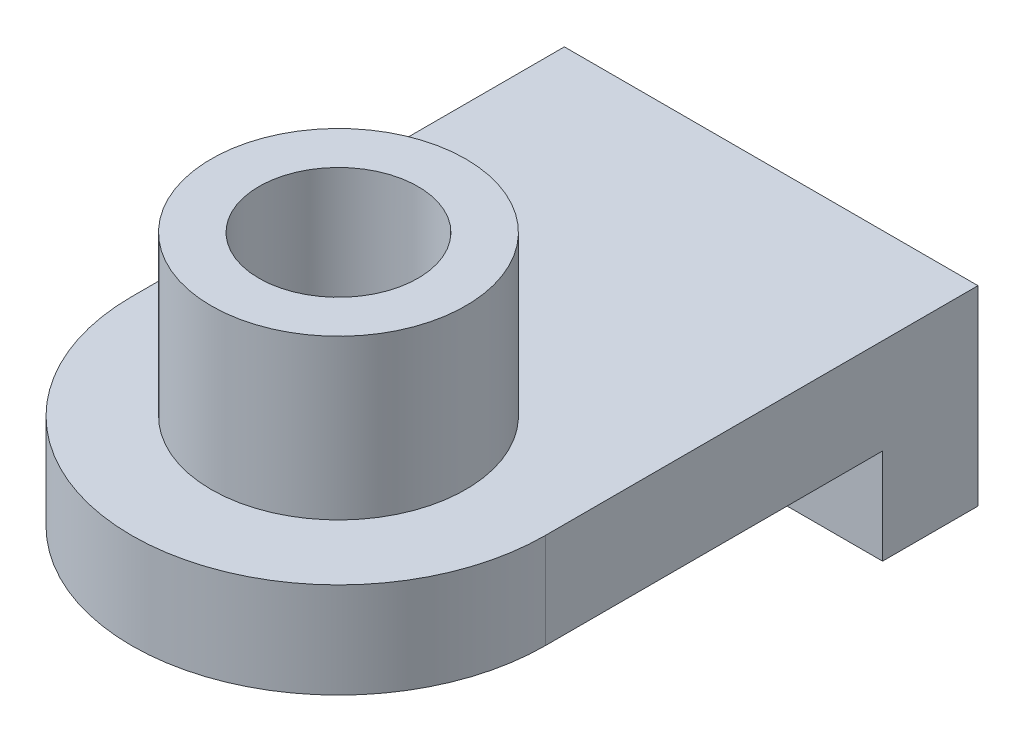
ISO-10303-21;
HEADER;
FILE_DESCRIPTION(('STEP AP214'),'2;1');
FILE_NAME('part.step','',(''),(''),'','','');
FILE_SCHEMA(('AUTOMOTIVE_DESIGN { 1 0 10303 214 1 1 1 1 }'));
ENDSEC;
DATA;
#1=APPLICATION_CONTEXT('core data for automotive mechanical design processes');
#2=APPLICATION_PROTOCOL_DEFINITION('international standard','automotive_design',2000,#1);
#3=PRODUCT_CONTEXT('',#1,'mechanical');
#4=PRODUCT('Part','Part','',(#3));
#5=PRODUCT_RELATED_PRODUCT_CATEGORY('part','',(#4));
#6=PRODUCT_DEFINITION_FORMATION('','',#4);
#7=PRODUCT_DEFINITION_CONTEXT('part definition',#1,'design');
#8=PRODUCT_DEFINITION('design','',#6,#7);
#9=PRODUCT_DEFINITION_SHAPE('','',#8);
#10=(LENGTH_UNIT() NAMED_UNIT(*) SI_UNIT(.MILLI.,.METRE.));
#11=(NAMED_UNIT(*) PLANE_ANGLE_UNIT() SI_UNIT($,.RADIAN.));
#12=(NAMED_UNIT(*) SI_UNIT($,.STERADIAN.) SOLID_ANGLE_UNIT());
#13=UNCERTAINTY_MEASURE_WITH_UNIT(LENGTH_MEASURE(1.E-05),#10,'distance_accuracy_value','');
#14=(GEOMETRIC_REPRESENTATION_CONTEXT(3) GLOBAL_UNCERTAINTY_ASSIGNED_CONTEXT((#13)) GLOBAL_UNIT_ASSIGNED_CONTEXT((#10,
#11,#12)) REPRESENTATION_CONTEXT('',''));
#15=CARTESIAN_POINT('',(0.,0.,0.));
#16=DIRECTION('',(0.,0.,1.));
#17=DIRECTION('',(1.,0.,0.));
#18=AXIS2_PLACEMENT_3D('',#15,#16,#17);
#19=CARTESIAN_POINT('',(0.,15.,0.));
#20=DIRECTION('',(0.,-1.,0.));
#21=DIRECTION('',(0.,0.,-1.));
#22=AXIS2_PLACEMENT_3D('',#19,#20,#21);
#23=PLANE('',#22);
#24=CARTESIAN_POINT('',(0.,15.,0.));
#25=DIRECTION('',(0.,1.,0.));
#26=DIRECTION('',(0.,0.,-1.));
#27=AXIS2_PLACEMENT_3D('',#24,#25,#26);
#28=CIRCLE('',#27,32.5);
#29=CARTESIAN_POINT('',(-32.5,15.,0.));
#30=VERTEX_POINT('',#29);
#31=CARTESIAN_POINT('',(32.5,15.,0.));
#32=VERTEX_POINT('',#31);
#33=EDGE_CURVE('E125',#30,#32,#28,.T.);
#34=ORIENTED_EDGE('',*,*,#33,.T.);
#35=DIRECTION('',(0.,0.,-1.));
#36=VECTOR('',#35,1.);
#37=CARTESIAN_POINT('',(32.5,15.,-68.));
#38=LINE('',#37,#36);
#39=CARTESIAN_POINT('',(32.5,15.,-68.));
#40=VERTEX_POINT('',#39);
#41=EDGE_CURVE('E77',#32,#40,#38,.T.);
#42=ORIENTED_EDGE('',*,*,#41,.T.);
#43=DIRECTION('',(-1.,0.,0.));
#44=VECTOR('',#43,1.);
#45=CARTESIAN_POINT('',(-32.5,15.,-68.));
#46=LINE('',#45,#44);
#47=CARTESIAN_POINT('',(-32.5,15.,-68.));
#48=VERTEX_POINT('',#47);
#49=EDGE_CURVE('E156',#40,#48,#46,.T.);
#50=ORIENTED_EDGE('',*,*,#49,.T.);
#51=DIRECTION('',(0.,0.,1.));
#52=VECTOR('',#51,1.);
#53=CARTESIAN_POINT('',(-32.5,15.,0.));
#54=LINE('',#53,#52);
#55=EDGE_CURVE('E56',#48,#30,#54,.T.);
#56=ORIENTED_EDGE('',*,*,#55,.T.);
#57=EDGE_LOOP('',(#34,#42,#50,#56));
#58=FACE_BOUND('',#57,.T.);
#59=CARTESIAN_POINT('',(0.,15.,0.));
#60=DIRECTION('',(0.,-1.,0.));
#61=DIRECTION('',(0.,0.,-1.));
#62=AXIS2_PLACEMENT_3D('',#59,#60,#61);
#63=CIRCLE('',#62,20.);
#64=CARTESIAN_POINT('',(0.,15.,-20.));
#65=VERTEX_POINT('',#64);
#66=EDGE_CURVE('E11',#65,#65,#63,.F.);
#67=ORIENTED_EDGE('',*,*,#66,.F.);
#68=EDGE_LOOP('',(#67));
#69=FACE_BOUND('',#68,.T.);
#70=ADVANCED_FACE('F32',(#58,#69),#23,.F.);
#71=CARTESIAN_POINT('',(0.,15.,0.));
#72=DIRECTION('',(0.,-1.,0.));
#73=DIRECTION('',(0.,0.,-1.));
#74=AXIS2_PLACEMENT_3D('',#71,#72,#73);
#75=CYLINDRICAL_SURFACE('',#74,32.5);
#76=CARTESIAN_POINT('',(0.,0.,0.));
#77=DIRECTION('',(0.,1.,0.));
#78=DIRECTION('',(0.,0.,-1.));
#79=AXIS2_PLACEMENT_3D('',#76,#77,#78);
#80=CIRCLE('',#79,32.5);
#81=CARTESIAN_POINT('',(-32.5,0.,0.));
#82=VERTEX_POINT('',#81);
#83=CARTESIAN_POINT('',(32.5,0.,0.));
#84=VERTEX_POINT('',#83);
#85=EDGE_CURVE('E137',#82,#84,#80,.T.);
#86=ORIENTED_EDGE('',*,*,#85,.T.);
#87=DIRECTION('',(0.,-1.,0.));
#88=VECTOR('',#87,1.);
#89=CARTESIAN_POINT('',(32.5,15.,0.));
#90=LINE('',#89,#88);
#91=EDGE_CURVE('E40',#32,#84,#90,.T.);
#92=ORIENTED_EDGE('',*,*,#91,.F.);
#93=ORIENTED_EDGE('',*,*,#33,.F.);
#94=DIRECTION('',(0.,-1.,0.));
#95=VECTOR('',#94,1.);
#96=CARTESIAN_POINT('',(-32.5,15.,0.));
#97=LINE('',#96,#95);
#98=EDGE_CURVE('E101',#30,#82,#97,.T.);
#99=ORIENTED_EDGE('',*,*,#98,.T.);
#100=EDGE_LOOP('',(#86,#92,#93,#99));
#101=FACE_BOUND('',#100,.T.);
#102=ADVANCED_FACE('F34',(#101),#75,.T.);
#103=CARTESIAN_POINT('',(32.5,15.,-68.));
#104=DIRECTION('',(-1.,0.,0.));
#105=DIRECTION('',(0.,0.,1.));
#106=AXIS2_PLACEMENT_3D('',#103,#104,#105);
#107=PLANE('',#106);
#108=DIRECTION('',(0.,0.,-1.));
#109=VECTOR('',#108,1.);
#110=CARTESIAN_POINT('',(32.5,0.,-68.));
#111=LINE('',#110,#109);
#112=CARTESIAN_POINT('',(32.5,0.,-53.));
#113=VERTEX_POINT('',#112);
#114=EDGE_CURVE('E129',#84,#113,#111,.T.);
#115=ORIENTED_EDGE('',*,*,#114,.T.);
#116=DIRECTION('',(0.,1.,0.));
#117=VECTOR('',#116,1.);
#118=CARTESIAN_POINT('',(32.5,-15.,-53.));
#119=LINE('',#118,#117);
#120=CARTESIAN_POINT('',(32.5,-15.,-53.));
#121=VERTEX_POINT('',#120);
#122=EDGE_CURVE('E133',#121,#113,#119,.T.);
#123=ORIENTED_EDGE('',*,*,#122,.F.);
#124=DIRECTION('',(0.,0.,1.));
#125=VECTOR('',#124,1.);
#126=CARTESIAN_POINT('',(32.5,-15.,-68.));
#127=LINE('',#126,#125);
#128=CARTESIAN_POINT('',(32.5,-15.,-68.));
#129=VERTEX_POINT('',#128);
#130=EDGE_CURVE('E108',#129,#121,#127,.T.);
#131=ORIENTED_EDGE('',*,*,#130,.F.);
#132=DIRECTION('',(0.,-1.,0.));
#133=VECTOR('',#132,1.);
#134=CARTESIAN_POINT('',(32.5,15.,-68.));
#135=LINE('',#134,#133);
#136=EDGE_CURVE('E100',#40,#129,#135,.T.);
#137=ORIENTED_EDGE('',*,*,#136,.F.);
#138=ORIENTED_EDGE('',*,*,#41,.F.);
#139=ORIENTED_EDGE('',*,*,#91,.T.);
#140=EDGE_LOOP('',(#115,#123,#131,#137,#138,#139));
#141=FACE_BOUND('',#140,.T.);
#142=ADVANCED_FACE('F154',(#141),#107,.F.);
#143=CARTESIAN_POINT('',(-32.5,15.,-68.));
#144=DIRECTION('',(0.,0.,1.));
#145=DIRECTION('',(1.,0.,0.));
#146=AXIS2_PLACEMENT_3D('',#143,#144,#145);
#147=PLANE('',#146);
#148=ORIENTED_EDGE('',*,*,#136,.T.);
#149=DIRECTION('',(1.,0.,0.));
#150=VECTOR('',#149,1.);
#151=CARTESIAN_POINT('',(-32.5,-15.,-68.));
#152=LINE('',#151,#150);
#153=CARTESIAN_POINT('',(-32.5,-15.,-68.));
#154=VERTEX_POINT('',#153);
#155=EDGE_CURVE('E104',#154,#129,#152,.T.);
#156=ORIENTED_EDGE('',*,*,#155,.F.);
#157=DIRECTION('',(0.,-1.,0.));
#158=VECTOR('',#157,1.);
#159=CARTESIAN_POINT('',(-32.5,15.,-68.));
#160=LINE('',#159,#158);
#161=EDGE_CURVE('E93',#48,#154,#160,.T.);
#162=ORIENTED_EDGE('',*,*,#161,.F.);
#163=ORIENTED_EDGE('',*,*,#49,.F.);
#164=EDGE_LOOP('',(#148,#156,#162,#163));
#165=FACE_BOUND('',#164,.T.);
#166=ADVANCED_FACE('F105',(#165),#147,.F.);
#167=CARTESIAN_POINT('',(-32.5,15.,0.));
#168=DIRECTION('',(1.,0.,0.));
#169=DIRECTION('',(0.,0.,-1.));
#170=AXIS2_PLACEMENT_3D('',#167,#168,#169);
#171=PLANE('',#170);
#172=ORIENTED_EDGE('',*,*,#161,.T.);
#173=DIRECTION('',(0.,0.,-1.));
#174=VECTOR('',#173,1.);
#175=CARTESIAN_POINT('',(-32.5,-15.,-68.));
#176=LINE('',#175,#174);
#177=CARTESIAN_POINT('',(-32.5,-15.,-53.));
#178=VERTEX_POINT('',#177);
#179=EDGE_CURVE('E97',#178,#154,#176,.T.);
#180=ORIENTED_EDGE('',*,*,#179,.F.);
#181=DIRECTION('',(0.,1.,0.));
#182=VECTOR('',#181,1.);
#183=CARTESIAN_POINT('',(-32.5,-15.,-53.));
#184=LINE('',#183,#182);
#185=CARTESIAN_POINT('',(-32.5,0.,-53.));
#186=VERTEX_POINT('',#185);
#187=EDGE_CURVE('E122',#178,#186,#184,.T.);
#188=ORIENTED_EDGE('',*,*,#187,.T.);
#189=DIRECTION('',(0.,0.,1.));
#190=VECTOR('',#189,1.);
#191=CARTESIAN_POINT('',(-32.5,0.,0.));
#192=LINE('',#191,#190);
#193=EDGE_CURVE('E69',#186,#82,#192,.T.);
#194=ORIENTED_EDGE('',*,*,#193,.T.);
#195=ORIENTED_EDGE('',*,*,#98,.F.);
#196=ORIENTED_EDGE('',*,*,#55,.F.);
#197=EDGE_LOOP('',(#172,#180,#188,#194,#195,#196));
#198=FACE_BOUND('',#197,.T.);
#199=ADVANCED_FACE('F95',(#198),#171,.F.);
#200=CARTESIAN_POINT('',(0.,0.,0.));
#201=DIRECTION('',(0.,-1.,0.));
#202=DIRECTION('',(0.,0.,-1.));
#203=AXIS2_PLACEMENT_3D('',#200,#201,#202);
#204=PLANE('',#203);
#205=CARTESIAN_POINT('',(0.,0.,0.));
#206=DIRECTION('',(0.,-1.,0.));
#207=DIRECTION('',(0.,0.,-1.));
#208=AXIS2_PLACEMENT_3D('',#205,#206,#207);
#209=CIRCLE('',#208,12.5);
#210=CARTESIAN_POINT('',(0.,0.,-12.5));
#211=VERTEX_POINT('',#210);
#212=EDGE_CURVE('E235',#211,#211,#209,.T.);
#213=ORIENTED_EDGE('',*,*,#212,.F.);
#214=EDGE_LOOP('',(#213));
#215=FACE_BOUND('',#214,.T.);
#216=DIRECTION('',(-1.,0.,0.));
#217=VECTOR('',#216,1.);
#218=CARTESIAN_POINT('',(-32.5,0.,-53.));
#219=LINE('',#218,#217);
#220=EDGE_CURVE('E47',#113,#186,#219,.T.);
#221=ORIENTED_EDGE('',*,*,#220,.F.);
#222=ORIENTED_EDGE('',*,*,#114,.F.);
#223=ORIENTED_EDGE('',*,*,#85,.F.);
#224=ORIENTED_EDGE('',*,*,#193,.F.);
#225=EDGE_LOOP('',(#221,#222,#223,#224));
#226=FACE_BOUND('',#225,.T.);
#227=ADVANCED_FACE('F180',(#215,#226),#204,.T.);
#228=CARTESIAN_POINT('',(-32.5,-15.,-53.));
#229=DIRECTION('',(0.,0.,-1.));
#230=DIRECTION('',(-1.,0.,0.));
#231=AXIS2_PLACEMENT_3D('',#228,#229,#230);
#232=PLANE('',#231);
#233=ORIENTED_EDGE('',*,*,#220,.T.);
#234=ORIENTED_EDGE('',*,*,#187,.F.);
#235=DIRECTION('',(-1.,0.,0.));
#236=VECTOR('',#235,1.);
#237=CARTESIAN_POINT('',(-32.5,-15.,-53.));
#238=LINE('',#237,#236);
#239=EDGE_CURVE('E112',#121,#178,#238,.T.);
#240=ORIENTED_EDGE('',*,*,#239,.F.);
#241=ORIENTED_EDGE('',*,*,#122,.T.);
#242=EDGE_LOOP('',(#233,#234,#240,#241));
#243=FACE_BOUND('',#242,.T.);
#244=ADVANCED_FACE('F174',(#243),#232,.F.);
#245=CARTESIAN_POINT('',(-32.5,-15.,-53.));
#246=DIRECTION('',(0.,1.,0.));
#247=DIRECTION('',(0.,0.,1.));
#248=AXIS2_PLACEMENT_3D('',#245,#246,#247);
#249=PLANE('',#248);
#250=ORIENTED_EDGE('',*,*,#179,.T.);
#251=ORIENTED_EDGE('',*,*,#155,.T.);
#252=ORIENTED_EDGE('',*,*,#130,.T.);
#253=ORIENTED_EDGE('',*,*,#239,.T.);
#254=EDGE_LOOP('',(#250,#251,#252,#253));
#255=FACE_BOUND('',#254,.T.);
#256=ADVANCED_FACE('F110',(#255),#249,.F.);
#257=CARTESIAN_POINT('',(0.,40.,0.));
#258=DIRECTION('',(0.,-1.,0.));
#259=DIRECTION('',(0.,0.,-1.));
#260=AXIS2_PLACEMENT_3D('',#257,#258,#259);
#261=CYLINDRICAL_SURFACE('',#260,20.);
#262=CARTESIAN_POINT('',(0.,40.,0.));
#263=DIRECTION('',(0.,1.,0.));
#264=DIRECTION('',(0.,0.,1.));
#265=AXIS2_PLACEMENT_3D('',#262,#263,#264);
#266=CIRCLE('',#265,20.);
#267=CARTESIAN_POINT('',(0.,40.,20.));
#268=VERTEX_POINT('',#267);
#269=EDGE_CURVE('E115',#268,#268,#266,.T.);
#270=ORIENTED_EDGE('',*,*,#269,.F.);
#271=EDGE_LOOP('',(#270));
#272=FACE_BOUND('',#271,.T.);
#273=ORIENTED_EDGE('',*,*,#66,.T.);
#274=EDGE_LOOP('',(#273));
#275=FACE_BOUND('',#274,.T.);
#276=ADVANCED_FACE('F162',(#272,#275),#261,.T.);
#277=CARTESIAN_POINT('',(0.,40.,0.));
#278=DIRECTION('',(0.,1.,0.));
#279=DIRECTION('',(0.,0.,1.));
#280=AXIS2_PLACEMENT_3D('',#277,#278,#279);
#281=PLANE('',#280);
#282=CARTESIAN_POINT('',(0.,40.,0.));
#283=DIRECTION('',(0.,1.,0.));
#284=DIRECTION('',(0.,0.,1.));
#285=AXIS2_PLACEMENT_3D('',#282,#283,#284);
#286=CIRCLE('',#285,12.5);
#287=CARTESIAN_POINT('',(0.,40.,12.5));
#288=VERTEX_POINT('',#287);
#289=EDGE_CURVE('E238',#288,#288,#286,.T.);
#290=ORIENTED_EDGE('',*,*,#289,.F.);
#291=EDGE_LOOP('',(#290));
#292=FACE_BOUND('',#291,.T.);
#293=ORIENTED_EDGE('',*,*,#269,.T.);
#294=EDGE_LOOP('',(#293));
#295=FACE_BOUND('',#294,.T.);
#296=ADVANCED_FACE('F164',(#292,#295),#281,.T.);
#297=CARTESIAN_POINT('',(0.,-15.000025,0.));
#298=DIRECTION('',(0.,1.,0.));
#299=DIRECTION('',(0.,0.,1.));
#300=AXIS2_PLACEMENT_3D('',#297,#298,#299);
#301=CYLINDRICAL_SURFACE('',#300,12.5);
#302=ORIENTED_EDGE('',*,*,#212,.T.);
#303=EDGE_LOOP('',(#302));
#304=FACE_BOUND('',#303,.T.);
#305=ORIENTED_EDGE('',*,*,#289,.T.);
#306=EDGE_LOOP('',(#305));
#307=FACE_BOUND('',#306,.T.);
#308=ADVANCED_FACE('F171',(#304,#307),#301,.F.);
#309=CLOSED_SHELL('',(#70,#102,#142,#166,#199,#227,#244,#256,#276,#296,#308));
#310=MANIFOLD_SOLID_BREP('B2',#309);
#311=ADVANCED_BREP_SHAPE_REPRESENTATION('',(#18,#310),#14);
#312=SHAPE_DEFINITION_REPRESENTATION(#9,#311);
ENDSEC;
END-ISO-10303-21;
